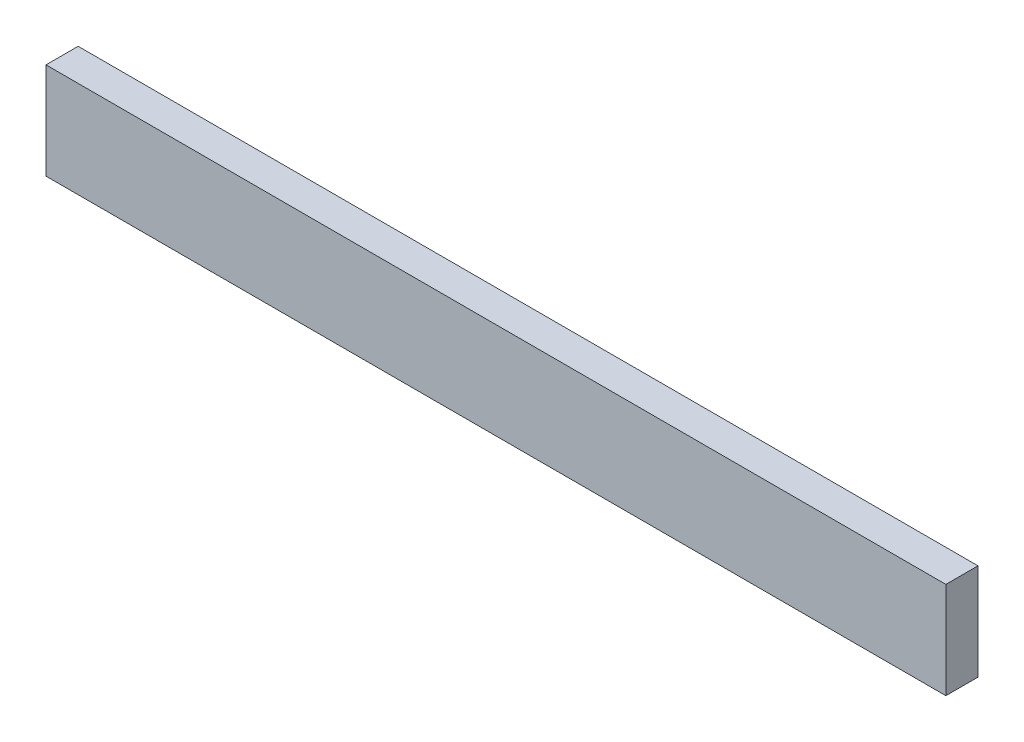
from build123d import *

# Parameters (mm, degrees)
SKETCH1_W           = 50.8
SKETCH1_H           = 12.7
SKETCH1_W_2         = 304.8
BOSS_EXTRUDE1_DEPTH = 38.1


with BuildPart() as part:
    # Sketch1 → Boss-Extrude1 (new body)
    with BuildSketch(Plane(origin=(0, 0, 0), x_dir=(1, 0, 0), z_dir=(0, 1, 0))):
        with Locations((-330.2, 6.35)):
            Rectangle(SKETCH1_W, SKETCH1_H)
        with Locations((-152.4, 6.35)):
            Rectangle(SKETCH1_W_2, SKETCH1_H)
    extrude(amount=BOSS_EXTRUDE1_DEPTH)


solid = part.part
